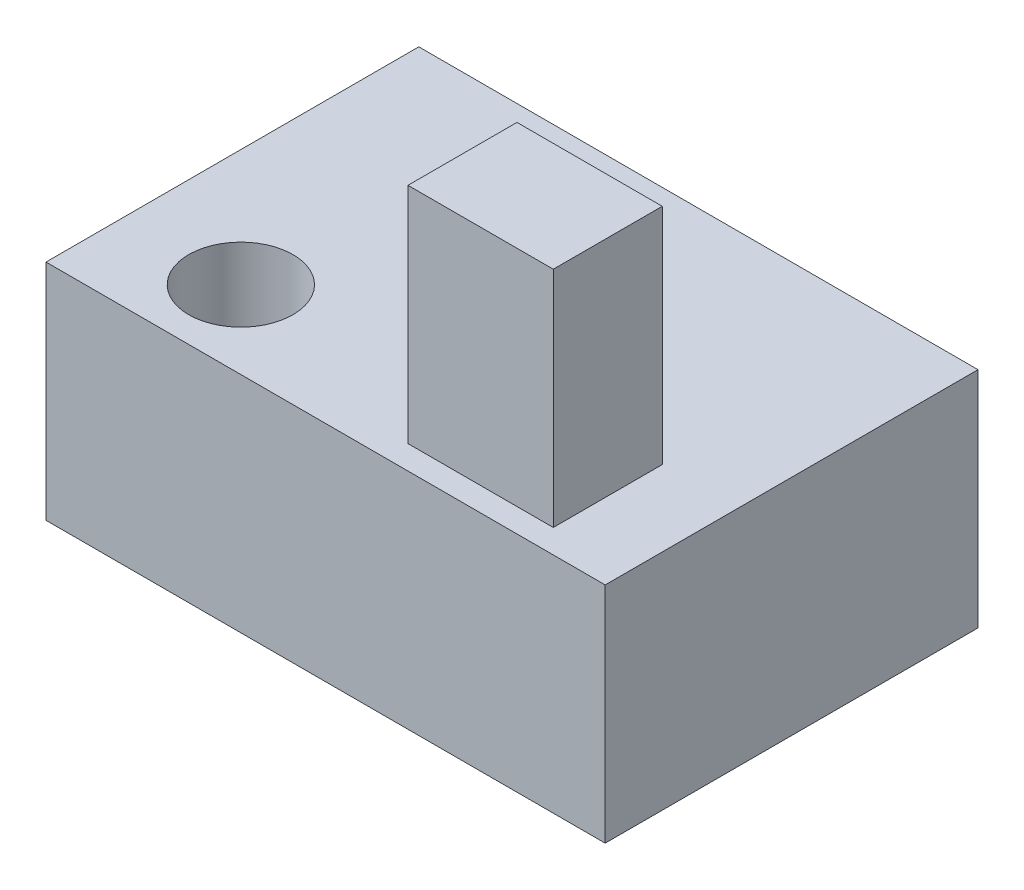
from build123d import *

# Parameters (mm, degrees)
SKETCH5_W          = 150
SKETCH5_H          = 100
EXTRUDE2_DEPTH     = 60
SKETCH6_W          = 38.974604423
SKETCH6_H          = 29.230953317
EXTRUDE3_DEPTH     = 60
SKETCH7_R          = 13.978094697
CUT_EXTRUDE4_DEPTH = 20


with BuildPart() as part:
    # Sketch5 → Extrude2 (new body)
    with BuildSketch(Plane(origin=(0, 0, 0), x_dir=(1, 0, 0), z_dir=(0, 1, 0))):
        Rectangle(SKETCH5_W, SKETCH5_H)
    extrude(amount=EXTRUDE2_DEPTH)

    # Sketch6 → Extrude3 (add)
    with BuildSketch(Plane(origin=(0, 60, 0), x_dir=(-1, 0, 0), z_dir=(0, 1, 0))):
        with Locations((-35.210011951, 29.009506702)):
            Rectangle(SKETCH6_W, SKETCH6_H)
    extrude(amount=EXTRUDE3_DEPTH)

    # Sketch7 → Cut-Extrude4 (cut)
    with BuildSketch(Plane(origin=(0, 60, 0), x_dir=(-1, 0, 0), z_dir=(0, 1, 0))):
        with Locations(Location((43.618920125, 29.116465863, 0), (0, 0, 90))):
            Circle(SKETCH7_R)
    extrude(amount=-CUT_EXTRUDE4_DEPTH, mode=Mode.SUBTRACT)


solid = part.part
